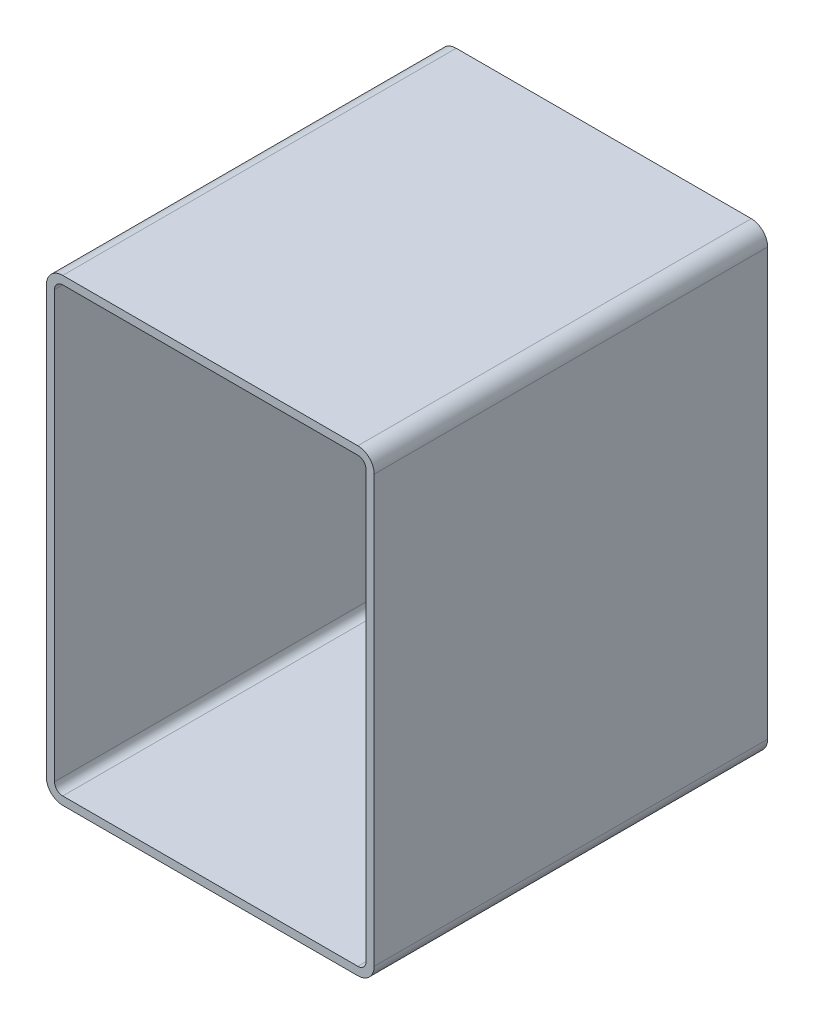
ISO-10303-21;
HEADER;
FILE_DESCRIPTION(('STEP AP214'),'2;1');
FILE_NAME('part.step','',(''),(''),'','','');
FILE_SCHEMA(('AUTOMOTIVE_DESIGN { 1 0 10303 214 1 1 1 1 }'));
ENDSEC;
DATA;
#1=APPLICATION_CONTEXT('core data for automotive mechanical design processes');
#2=APPLICATION_PROTOCOL_DEFINITION('international standard','automotive_design',2000,#1);
#3=PRODUCT_CONTEXT('',#1,'mechanical');
#4=PRODUCT('Part','Part','',(#3));
#5=PRODUCT_RELATED_PRODUCT_CATEGORY('part','',(#4));
#6=PRODUCT_DEFINITION_FORMATION('','',#4);
#7=PRODUCT_DEFINITION_CONTEXT('part definition',#1,'design');
#8=PRODUCT_DEFINITION('design','',#6,#7);
#9=PRODUCT_DEFINITION_SHAPE('','',#8);
#10=(LENGTH_UNIT() NAMED_UNIT(*) SI_UNIT(.MILLI.,.METRE.));
#11=(NAMED_UNIT(*) PLANE_ANGLE_UNIT() SI_UNIT($,.RADIAN.));
#12=(NAMED_UNIT(*) SI_UNIT($,.STERADIAN.) SOLID_ANGLE_UNIT());
#13=UNCERTAINTY_MEASURE_WITH_UNIT(LENGTH_MEASURE(1.E-05),#10,'distance_accuracy_value','');
#14=(GEOMETRIC_REPRESENTATION_CONTEXT(3) GLOBAL_UNCERTAINTY_ASSIGNED_CONTEXT((#13)) GLOBAL_UNIT_ASSIGNED_CONTEXT((#10,
#11,#12)) REPRESENTATION_CONTEXT('',''));
#15=CARTESIAN_POINT('',(0.,0.,0.));
#16=DIRECTION('',(0.,0.,1.));
#17=DIRECTION('',(1.,0.,0.));
#18=AXIS2_PLACEMENT_3D('',#15,#16,#17);
#19=CARTESIAN_POINT('',(15.4345794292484,344.728679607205,304.8));
#20=DIRECTION('',(0.,0.,1.));
#21=DIRECTION('',(1.,0.,0.));
#22=AXIS2_PLACEMENT_3D('',#19,#20,#21);
#23=PLANE('',#22);
#24=CARTESIAN_POINT('',(15.4345794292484,344.728679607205,304.8));
#25=DIRECTION('',(0.,0.,1.));
#26=DIRECTION('',(1.,0.,0.));
#27=AXIS2_PLACEMENT_3D('',#24,#25,#26);
#28=CIRCLE('',#27,12.7);
#29=CARTESIAN_POINT('',(15.4345794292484,357.428679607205,304.8));
#30=VERTEX_POINT('',#29);
#31=CARTESIAN_POINT('',(2.73457942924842,344.728679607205,304.8));
#32=VERTEX_POINT('',#31);
#33=EDGE_CURVE('E211',#30,#32,#28,.T.);
#34=ORIENTED_EDGE('',*,*,#33,.T.);
#35=DIRECTION('',(0.,-1.,0.));
#36=VECTOR('',#35,1.);
#37=CARTESIAN_POINT('',(2.73457942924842,14.5286796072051,304.8));
#38=LINE('',#37,#36);
#39=CARTESIAN_POINT('',(2.73457942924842,14.5286796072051,304.8));
#40=VERTEX_POINT('',#39);
#41=EDGE_CURVE('E214',#32,#40,#38,.T.);
#42=ORIENTED_EDGE('',*,*,#41,.T.);
#43=CARTESIAN_POINT('',(15.4345794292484,14.5286796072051,304.8));
#44=DIRECTION('',(0.,0.,1.));
#45=DIRECTION('',(1.,0.,0.));
#46=AXIS2_PLACEMENT_3D('',#43,#44,#45);
#47=CIRCLE('',#46,12.7);
#48=CARTESIAN_POINT('',(15.4345794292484,1.82867960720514,304.8));
#49=VERTEX_POINT('',#48);
#50=EDGE_CURVE('E217',#40,#49,#47,.T.);
#51=ORIENTED_EDGE('',*,*,#50,.T.);
#52=DIRECTION('',(1.,0.,0.));
#53=VECTOR('',#52,1.);
#54=CARTESIAN_POINT('',(244.034579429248,1.82867960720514,304.8));
#55=LINE('',#54,#53);
#56=CARTESIAN_POINT('',(244.034579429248,1.82867960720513,304.8));
#57=VERTEX_POINT('',#56);
#58=EDGE_CURVE('E219',#49,#57,#55,.T.);
#59=ORIENTED_EDGE('',*,*,#58,.T.);
#60=CARTESIAN_POINT('',(244.034579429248,14.5286796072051,304.8));
#61=DIRECTION('',(0.,0.,1.));
#62=DIRECTION('',(1.,0.,0.));
#63=AXIS2_PLACEMENT_3D('',#60,#61,#62);
#64=CIRCLE('',#63,12.7);
#65=CARTESIAN_POINT('',(256.734579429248,14.5286796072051,304.8));
#66=VERTEX_POINT('',#65);
#67=EDGE_CURVE('E221',#57,#66,#64,.T.);
#68=ORIENTED_EDGE('',*,*,#67,.T.);
#69=DIRECTION('',(0.,1.,0.));
#70=VECTOR('',#69,1.);
#71=CARTESIAN_POINT('',(256.734579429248,344.728679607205,304.8));
#72=LINE('',#71,#70);
#73=CARTESIAN_POINT('',(256.734579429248,344.728679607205,304.8));
#74=VERTEX_POINT('',#73);
#75=EDGE_CURVE('E223',#66,#74,#72,.T.);
#76=ORIENTED_EDGE('',*,*,#75,.T.);
#77=CARTESIAN_POINT('',(244.034579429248,344.728679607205,304.8));
#78=DIRECTION('',(0.,0.,1.));
#79=DIRECTION('',(1.,0.,0.));
#80=AXIS2_PLACEMENT_3D('',#77,#78,#79);
#81=CIRCLE('',#80,12.7);
#82=CARTESIAN_POINT('',(244.034579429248,357.428679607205,304.8));
#83=VERTEX_POINT('',#82);
#84=EDGE_CURVE('E225',#74,#83,#81,.T.);
#85=ORIENTED_EDGE('',*,*,#84,.T.);
#86=DIRECTION('',(-1.,0.,0.));
#87=VECTOR('',#86,1.);
#88=CARTESIAN_POINT('',(15.4345794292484,357.428679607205,304.8));
#89=LINE('',#88,#87);
#90=EDGE_CURVE('E227',#83,#30,#89,.T.);
#91=ORIENTED_EDGE('',*,*,#90,.T.);
#92=EDGE_LOOP('',(#34,#42,#51,#59,#68,#76,#85,#91));
#93=FACE_BOUND('',#92,.T.);
#94=DIRECTION('',(0.,-1.,0.));
#95=VECTOR('',#94,1.);
#96=CARTESIAN_POINT('',(9.08457942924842,14.5286796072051,304.8));
#97=LINE('',#96,#95);
#98=CARTESIAN_POINT('',(9.08457942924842,344.728679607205,304.8));
#99=VERTEX_POINT('',#98);
#100=CARTESIAN_POINT('',(9.08457942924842,14.5286796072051,304.8));
#101=VERTEX_POINT('',#100);
#102=EDGE_CURVE('E154',#99,#101,#97,.T.);
#103=ORIENTED_EDGE('',*,*,#102,.F.);
#104=CARTESIAN_POINT('',(15.4345794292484,344.728679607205,304.8));
#105=DIRECTION('',(0.,0.,1.));
#106=DIRECTION('',(1.,0.,0.));
#107=AXIS2_PLACEMENT_3D('',#104,#105,#106);
#108=CIRCLE('',#107,6.35000000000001);
#109=CARTESIAN_POINT('',(15.4345794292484,351.078679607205,304.8));
#110=VERTEX_POINT('',#109);
#111=EDGE_CURVE('E146',#110,#99,#108,.T.);
#112=ORIENTED_EDGE('',*,*,#111,.F.);
#113=DIRECTION('',(-1.,0.,0.));
#114=VECTOR('',#113,1.);
#115=CARTESIAN_POINT('',(15.4345794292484,351.078679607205,304.8));
#116=LINE('',#115,#114);
#117=CARTESIAN_POINT('',(244.034579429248,351.078679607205,304.8));
#118=VERTEX_POINT('',#117);
#119=EDGE_CURVE('E179',#118,#110,#116,.T.);
#120=ORIENTED_EDGE('',*,*,#119,.F.);
#121=CARTESIAN_POINT('',(244.034579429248,344.728679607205,304.8));
#122=DIRECTION('',(0.,0.,1.));
#123=DIRECTION('',(1.,0.,0.));
#124=AXIS2_PLACEMENT_3D('',#121,#122,#123);
#125=CIRCLE('',#124,6.35000000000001);
#126=CARTESIAN_POINT('',(250.384579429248,344.728679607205,304.8));
#127=VERTEX_POINT('',#126);
#128=EDGE_CURVE('E177',#127,#118,#125,.T.);
#129=ORIENTED_EDGE('',*,*,#128,.F.);
#130=DIRECTION('',(0.,1.,0.));
#131=VECTOR('',#130,1.);
#132=CARTESIAN_POINT('',(250.384579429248,344.728679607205,304.8));
#133=LINE('',#132,#131);
#134=CARTESIAN_POINT('',(250.384579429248,14.5286796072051,304.8));
#135=VERTEX_POINT('',#134);
#136=EDGE_CURVE('E175',#135,#127,#133,.T.);
#137=ORIENTED_EDGE('',*,*,#136,.F.);
#138=CARTESIAN_POINT('',(244.034579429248,14.5286796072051,304.8));
#139=DIRECTION('',(0.,0.,1.));
#140=DIRECTION('',(1.,0.,0.));
#141=AXIS2_PLACEMENT_3D('',#138,#139,#140);
#142=CIRCLE('',#141,6.35);
#143=CARTESIAN_POINT('',(244.034579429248,8.17867960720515,304.8));
#144=VERTEX_POINT('',#143);
#145=EDGE_CURVE('E173',#144,#135,#142,.T.);
#146=ORIENTED_EDGE('',*,*,#145,.F.);
#147=DIRECTION('',(1.,0.,0.));
#148=VECTOR('',#147,1.);
#149=CARTESIAN_POINT('',(244.034579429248,8.17867960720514,304.8));
#150=LINE('',#149,#148);
#151=CARTESIAN_POINT('',(15.4345794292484,8.17867960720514,304.8));
#152=VERTEX_POINT('',#151);
#153=EDGE_CURVE('E169',#152,#144,#150,.T.);
#154=ORIENTED_EDGE('',*,*,#153,.F.);
#155=CARTESIAN_POINT('',(15.4345794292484,14.5286796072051,304.8));
#156=DIRECTION('',(0.,0.,1.));
#157=DIRECTION('',(1.,0.,0.));
#158=AXIS2_PLACEMENT_3D('',#155,#156,#157);
#159=CIRCLE('',#158,6.35);
#160=EDGE_CURVE('E167',#101,#152,#159,.T.);
#161=ORIENTED_EDGE('',*,*,#160,.F.);
#162=EDGE_LOOP('',(#103,#112,#120,#129,#137,#146,#154,#161));
#163=FACE_BOUND('',#162,.T.);
#164=ADVANCED_FACE('F33',(#93,#163),#23,.T.);
#165=CARTESIAN_POINT('',(15.4345794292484,344.728679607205,0.));
#166=DIRECTION('',(0.,0.,1.));
#167=DIRECTION('',(1.,0.,0.));
#168=AXIS2_PLACEMENT_3D('',#165,#166,#167);
#169=PLANE('',#168);
#170=CARTESIAN_POINT('',(15.4345794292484,344.728679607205,0.));
#171=DIRECTION('',(0.,0.,1.));
#172=DIRECTION('',(1.,0.,0.));
#173=AXIS2_PLACEMENT_3D('',#170,#171,#172);
#174=CIRCLE('',#173,12.7);
#175=CARTESIAN_POINT('',(15.4345794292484,357.428679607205,0.));
#176=VERTEX_POINT('',#175);
#177=CARTESIAN_POINT('',(2.73457942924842,344.728679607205,0.));
#178=VERTEX_POINT('',#177);
#179=EDGE_CURVE('E162',#176,#178,#174,.T.);
#180=ORIENTED_EDGE('',*,*,#179,.F.);
#181=DIRECTION('',(-1.,0.,0.));
#182=VECTOR('',#181,1.);
#183=CARTESIAN_POINT('',(15.4345794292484,357.428679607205,0.));
#184=LINE('',#183,#182);
#185=CARTESIAN_POINT('',(244.034579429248,357.428679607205,0.));
#186=VERTEX_POINT('',#185);
#187=EDGE_CURVE('E215',#186,#176,#184,.T.);
#188=ORIENTED_EDGE('',*,*,#187,.F.);
#189=CARTESIAN_POINT('',(244.034579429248,344.728679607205,0.));
#190=DIRECTION('',(0.,0.,1.));
#191=DIRECTION('',(1.,0.,0.));
#192=AXIS2_PLACEMENT_3D('',#189,#190,#191);
#193=CIRCLE('',#192,12.7);
#194=CARTESIAN_POINT('',(256.734579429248,344.728679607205,0.));
#195=VERTEX_POINT('',#194);
#196=EDGE_CURVE('E242',#195,#186,#193,.T.);
#197=ORIENTED_EDGE('',*,*,#196,.F.);
#198=DIRECTION('',(0.,1.,0.));
#199=VECTOR('',#198,1.);
#200=CARTESIAN_POINT('',(256.734579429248,344.728679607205,0.));
#201=LINE('',#200,#199);
#202=CARTESIAN_POINT('',(256.734579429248,14.5286796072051,0.));
#203=VERTEX_POINT('',#202);
#204=EDGE_CURVE('E240',#203,#195,#201,.T.);
#205=ORIENTED_EDGE('',*,*,#204,.F.);
#206=CARTESIAN_POINT('',(244.034579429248,14.5286796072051,0.));
#207=DIRECTION('',(0.,0.,1.));
#208=DIRECTION('',(1.,0.,0.));
#209=AXIS2_PLACEMENT_3D('',#206,#207,#208);
#210=CIRCLE('',#209,12.7);
#211=CARTESIAN_POINT('',(244.034579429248,1.82867960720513,0.));
#212=VERTEX_POINT('',#211);
#213=EDGE_CURVE('E238',#212,#203,#210,.T.);
#214=ORIENTED_EDGE('',*,*,#213,.F.);
#215=DIRECTION('',(1.,0.,0.));
#216=VECTOR('',#215,1.);
#217=CARTESIAN_POINT('',(244.034579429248,1.82867960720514,0.));
#218=LINE('',#217,#216);
#219=CARTESIAN_POINT('',(15.4345794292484,1.82867960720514,0.));
#220=VERTEX_POINT('',#219);
#221=EDGE_CURVE('E236',#220,#212,#218,.T.);
#222=ORIENTED_EDGE('',*,*,#221,.F.);
#223=CARTESIAN_POINT('',(15.4345794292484,14.5286796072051,0.));
#224=DIRECTION('',(0.,0.,1.));
#225=DIRECTION('',(1.,0.,0.));
#226=AXIS2_PLACEMENT_3D('',#223,#224,#225);
#227=CIRCLE('',#226,12.7);
#228=CARTESIAN_POINT('',(2.73457942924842,14.5286796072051,0.));
#229=VERTEX_POINT('',#228);
#230=EDGE_CURVE('E234',#229,#220,#227,.T.);
#231=ORIENTED_EDGE('',*,*,#230,.F.);
#232=DIRECTION('',(0.,-1.,0.));
#233=VECTOR('',#232,1.);
#234=CARTESIAN_POINT('',(2.73457942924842,14.5286796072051,0.));
#235=LINE('',#234,#233);
#236=EDGE_CURVE('E232',#178,#229,#235,.T.);
#237=ORIENTED_EDGE('',*,*,#236,.F.);
#238=EDGE_LOOP('',(#180,#188,#197,#205,#214,#222,#231,#237));
#239=FACE_BOUND('',#238,.T.);
#240=CARTESIAN_POINT('',(15.4345794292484,344.728679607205,0.));
#241=DIRECTION('',(0.,0.,1.));
#242=DIRECTION('',(1.,0.,0.));
#243=AXIS2_PLACEMENT_3D('',#240,#241,#242);
#244=CIRCLE('',#243,6.35000000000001);
#245=CARTESIAN_POINT('',(15.4345794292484,351.078679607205,0.));
#246=VERTEX_POINT('',#245);
#247=CARTESIAN_POINT('',(9.08457942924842,344.728679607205,0.));
#248=VERTEX_POINT('',#247);
#249=EDGE_CURVE('E56',#246,#248,#244,.T.);
#250=ORIENTED_EDGE('',*,*,#249,.T.);
#251=DIRECTION('',(0.,-1.,0.));
#252=VECTOR('',#251,1.);
#253=CARTESIAN_POINT('',(9.08457942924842,14.5286796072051,0.));
#254=LINE('',#253,#252);
#255=CARTESIAN_POINT('',(9.08457942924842,14.5286796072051,0.));
#256=VERTEX_POINT('',#255);
#257=EDGE_CURVE('E161',#248,#256,#254,.T.);
#258=ORIENTED_EDGE('',*,*,#257,.T.);
#259=CARTESIAN_POINT('',(15.4345794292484,14.5286796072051,0.));
#260=DIRECTION('',(0.,0.,1.));
#261=DIRECTION('',(1.,0.,0.));
#262=AXIS2_PLACEMENT_3D('',#259,#260,#261);
#263=CIRCLE('',#262,6.35);
#264=CARTESIAN_POINT('',(15.4345794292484,8.17867960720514,0.));
#265=VERTEX_POINT('',#264);
#266=EDGE_CURVE('E183',#256,#265,#263,.T.);
#267=ORIENTED_EDGE('',*,*,#266,.T.);
#268=DIRECTION('',(1.,0.,0.));
#269=VECTOR('',#268,1.);
#270=CARTESIAN_POINT('',(244.034579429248,8.17867960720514,0.));
#271=LINE('',#270,#269);
#272=CARTESIAN_POINT('',(244.034579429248,8.17867960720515,0.));
#273=VERTEX_POINT('',#272);
#274=EDGE_CURVE('E186',#265,#273,#271,.T.);
#275=ORIENTED_EDGE('',*,*,#274,.T.);
#276=CARTESIAN_POINT('',(244.034579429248,14.5286796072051,0.));
#277=DIRECTION('',(0.,0.,1.));
#278=DIRECTION('',(1.,0.,0.));
#279=AXIS2_PLACEMENT_3D('',#276,#277,#278);
#280=CIRCLE('',#279,6.35);
#281=CARTESIAN_POINT('',(250.384579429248,14.5286796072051,0.));
#282=VERTEX_POINT('',#281);
#283=EDGE_CURVE('E189',#273,#282,#280,.T.);
#284=ORIENTED_EDGE('',*,*,#283,.T.);
#285=DIRECTION('',(0.,1.,0.));
#286=VECTOR('',#285,1.);
#287=CARTESIAN_POINT('',(250.384579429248,344.728679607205,0.));
#288=LINE('',#287,#286);
#289=CARTESIAN_POINT('',(250.384579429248,344.728679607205,0.));
#290=VERTEX_POINT('',#289);
#291=EDGE_CURVE('E192',#282,#290,#288,.T.);
#292=ORIENTED_EDGE('',*,*,#291,.T.);
#293=CARTESIAN_POINT('',(244.034579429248,344.728679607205,0.));
#294=DIRECTION('',(0.,0.,1.));
#295=DIRECTION('',(1.,0.,0.));
#296=AXIS2_PLACEMENT_3D('',#293,#294,#295);
#297=CIRCLE('',#296,6.35000000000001);
#298=CARTESIAN_POINT('',(244.034579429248,351.078679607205,0.));
#299=VERTEX_POINT('',#298);
#300=EDGE_CURVE('E195',#290,#299,#297,.T.);
#301=ORIENTED_EDGE('',*,*,#300,.T.);
#302=DIRECTION('',(-1.,0.,0.));
#303=VECTOR('',#302,1.);
#304=CARTESIAN_POINT('',(15.4345794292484,351.078679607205,0.));
#305=LINE('',#304,#303);
#306=EDGE_CURVE('E155',#299,#246,#305,.T.);
#307=ORIENTED_EDGE('',*,*,#306,.T.);
#308=EDGE_LOOP('',(#250,#258,#267,#275,#284,#292,#301,#307));
#309=FACE_BOUND('',#308,.T.);
#310=ADVANCED_FACE('F272',(#239,#309),#169,.F.);
#311=CARTESIAN_POINT('',(15.4345794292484,344.728679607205,304.8));
#312=DIRECTION('',(0.,0.,-1.));
#313=DIRECTION('',(-1.,0.,0.));
#314=AXIS2_PLACEMENT_3D('',#311,#312,#313);
#315=CYLINDRICAL_SURFACE('',#314,12.7);
#316=ORIENTED_EDGE('',*,*,#179,.T.);
#317=DIRECTION('',(0.,0.,-1.));
#318=VECTOR('',#317,1.);
#319=CARTESIAN_POINT('',(2.73457942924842,344.728679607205,304.8));
#320=LINE('',#319,#318);
#321=EDGE_CURVE('E11',#32,#178,#320,.T.);
#322=ORIENTED_EDGE('',*,*,#321,.F.);
#323=ORIENTED_EDGE('',*,*,#33,.F.);
#324=DIRECTION('',(0.,0.,-1.));
#325=VECTOR('',#324,1.);
#326=CARTESIAN_POINT('',(15.4345794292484,357.428679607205,304.8));
#327=LINE('',#326,#325);
#328=EDGE_CURVE('E229',#30,#176,#327,.T.);
#329=ORIENTED_EDGE('',*,*,#328,.T.);
#330=EDGE_LOOP('',(#316,#322,#323,#329));
#331=FACE_BOUND('',#330,.T.);
#332=ADVANCED_FACE('F35',(#331),#315,.T.);
#333=CARTESIAN_POINT('',(2.73457942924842,14.5286796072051,304.8));
#334=DIRECTION('',(1.,0.,0.));
#335=DIRECTION('',(0.,0.,-1.));
#336=AXIS2_PLACEMENT_3D('',#333,#334,#335);
#337=PLANE('',#336);
#338=ORIENTED_EDGE('',*,*,#236,.T.);
#339=DIRECTION('',(0.,0.,-1.));
#340=VECTOR('',#339,1.);
#341=CARTESIAN_POINT('',(2.73457942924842,14.5286796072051,304.8));
#342=LINE('',#341,#340);
#343=EDGE_CURVE('E41',#40,#229,#342,.T.);
#344=ORIENTED_EDGE('',*,*,#343,.F.);
#345=ORIENTED_EDGE('',*,*,#41,.F.);
#346=ORIENTED_EDGE('',*,*,#321,.T.);
#347=EDGE_LOOP('',(#338,#344,#345,#346));
#348=FACE_BOUND('',#347,.T.);
#349=ADVANCED_FACE('F289',(#348),#337,.F.);
#350=CARTESIAN_POINT('',(15.4345794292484,14.5286796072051,304.8));
#351=DIRECTION('',(0.,0.,-1.));
#352=DIRECTION('',(-1.,0.,0.));
#353=AXIS2_PLACEMENT_3D('',#350,#351,#352);
#354=CYLINDRICAL_SURFACE('',#353,12.7);
#355=ORIENTED_EDGE('',*,*,#230,.T.);
#356=DIRECTION('',(0.,0.,-1.));
#357=VECTOR('',#356,1.);
#358=CARTESIAN_POINT('',(15.4345794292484,1.82867960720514,304.8));
#359=LINE('',#358,#357);
#360=EDGE_CURVE('E259',#49,#220,#359,.T.);
#361=ORIENTED_EDGE('',*,*,#360,.F.);
#362=ORIENTED_EDGE('',*,*,#50,.F.);
#363=ORIENTED_EDGE('',*,*,#343,.T.);
#364=EDGE_LOOP('',(#355,#361,#362,#363));
#365=FACE_BOUND('',#364,.T.);
#366=ADVANCED_FACE('F266',(#365),#354,.T.);
#367=CARTESIAN_POINT('',(244.034579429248,1.82867960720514,304.8));
#368=DIRECTION('',(0.,1.,0.));
#369=DIRECTION('',(0.,0.,1.));
#370=AXIS2_PLACEMENT_3D('',#367,#368,#369);
#371=PLANE('',#370);
#372=ORIENTED_EDGE('',*,*,#221,.T.);
#373=DIRECTION('',(0.,0.,-1.));
#374=VECTOR('',#373,1.);
#375=CARTESIAN_POINT('',(244.034579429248,1.82867960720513,304.8));
#376=LINE('',#375,#374);
#377=EDGE_CURVE('E256',#57,#212,#376,.T.);
#378=ORIENTED_EDGE('',*,*,#377,.F.);
#379=ORIENTED_EDGE('',*,*,#58,.F.);
#380=ORIENTED_EDGE('',*,*,#360,.T.);
#381=EDGE_LOOP('',(#372,#378,#379,#380));
#382=FACE_BOUND('',#381,.T.);
#383=ADVANCED_FACE('F278',(#382),#371,.F.);
#384=CARTESIAN_POINT('',(244.034579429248,14.5286796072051,304.8));
#385=DIRECTION('',(0.,0.,-1.));
#386=DIRECTION('',(-1.,0.,0.));
#387=AXIS2_PLACEMENT_3D('',#384,#385,#386);
#388=CYLINDRICAL_SURFACE('',#387,12.7);
#389=ORIENTED_EDGE('',*,*,#213,.T.);
#390=DIRECTION('',(0.,0.,-1.));
#391=VECTOR('',#390,1.);
#392=CARTESIAN_POINT('',(256.734579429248,14.5286796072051,304.8));
#393=LINE('',#392,#391);
#394=EDGE_CURVE('E253',#66,#203,#393,.T.);
#395=ORIENTED_EDGE('',*,*,#394,.F.);
#396=ORIENTED_EDGE('',*,*,#67,.F.);
#397=ORIENTED_EDGE('',*,*,#377,.T.);
#398=EDGE_LOOP('',(#389,#395,#396,#397));
#399=FACE_BOUND('',#398,.T.);
#400=ADVANCED_FACE('F282',(#399),#388,.T.);
#401=CARTESIAN_POINT('',(256.734579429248,344.728679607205,304.8));
#402=DIRECTION('',(-1.,0.,0.));
#403=DIRECTION('',(0.,0.,1.));
#404=AXIS2_PLACEMENT_3D('',#401,#402,#403);
#405=PLANE('',#404);
#406=ORIENTED_EDGE('',*,*,#204,.T.);
#407=DIRECTION('',(0.,0.,-1.));
#408=VECTOR('',#407,1.);
#409=CARTESIAN_POINT('',(256.734579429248,344.728679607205,304.8));
#410=LINE('',#409,#408);
#411=EDGE_CURVE('E250',#74,#195,#410,.T.);
#412=ORIENTED_EDGE('',*,*,#411,.F.);
#413=ORIENTED_EDGE('',*,*,#75,.F.);
#414=ORIENTED_EDGE('',*,*,#394,.T.);
#415=EDGE_LOOP('',(#406,#412,#413,#414));
#416=FACE_BOUND('',#415,.T.);
#417=ADVANCED_FACE('F302',(#416),#405,.F.);
#418=CARTESIAN_POINT('',(244.034579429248,344.728679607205,304.8));
#419=DIRECTION('',(0.,0.,-1.));
#420=DIRECTION('',(-1.,0.,0.));
#421=AXIS2_PLACEMENT_3D('',#418,#419,#420);
#422=CYLINDRICAL_SURFACE('',#421,12.7);
#423=ORIENTED_EDGE('',*,*,#196,.T.);
#424=DIRECTION('',(0.,0.,-1.));
#425=VECTOR('',#424,1.);
#426=CARTESIAN_POINT('',(244.034579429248,357.428679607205,304.8));
#427=LINE('',#426,#425);
#428=EDGE_CURVE('E247',#83,#186,#427,.T.);
#429=ORIENTED_EDGE('',*,*,#428,.F.);
#430=ORIENTED_EDGE('',*,*,#84,.F.);
#431=ORIENTED_EDGE('',*,*,#411,.T.);
#432=EDGE_LOOP('',(#423,#429,#430,#431));
#433=FACE_BOUND('',#432,.T.);
#434=ADVANCED_FACE('F300',(#433),#422,.T.);
#435=CARTESIAN_POINT('',(15.4345794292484,357.428679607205,304.8));
#436=DIRECTION('',(0.,-1.,0.));
#437=DIRECTION('',(0.,0.,-1.));
#438=AXIS2_PLACEMENT_3D('',#435,#436,#437);
#439=PLANE('',#438);
#440=ORIENTED_EDGE('',*,*,#187,.T.);
#441=ORIENTED_EDGE('',*,*,#328,.F.);
#442=ORIENTED_EDGE('',*,*,#90,.F.);
#443=ORIENTED_EDGE('',*,*,#428,.T.);
#444=EDGE_LOOP('',(#440,#441,#442,#443));
#445=FACE_BOUND('',#444,.T.);
#446=ADVANCED_FACE('F295',(#445),#439,.F.);
#447=CARTESIAN_POINT('',(15.4345794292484,344.728679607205,304.8));
#448=DIRECTION('',(0.,0.,-1.));
#449=DIRECTION('',(-1.,0.,0.));
#450=AXIS2_PLACEMENT_3D('',#447,#448,#449);
#451=CYLINDRICAL_SURFACE('',#450,6.35000000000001);
#452=ORIENTED_EDGE('',*,*,#249,.F.);
#453=DIRECTION('',(0.,0.,-1.));
#454=VECTOR('',#453,1.);
#455=CARTESIAN_POINT('',(15.4345794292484,351.078679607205,304.8));
#456=LINE('',#455,#454);
#457=EDGE_CURVE('E150',#110,#246,#456,.T.);
#458=ORIENTED_EDGE('',*,*,#457,.F.);
#459=ORIENTED_EDGE('',*,*,#111,.T.);
#460=DIRECTION('',(0.,0.,-1.));
#461=VECTOR('',#460,1.);
#462=CARTESIAN_POINT('',(9.08457942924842,344.728679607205,304.8));
#463=LINE('',#462,#461);
#464=EDGE_CURVE('E149',#99,#248,#463,.T.);
#465=ORIENTED_EDGE('',*,*,#464,.T.);
#466=EDGE_LOOP('',(#452,#458,#459,#465));
#467=FACE_BOUND('',#466,.T.);
#468=ADVANCED_FACE('F148',(#467),#451,.F.);
#469=CARTESIAN_POINT('',(9.08457942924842,14.5286796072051,304.8));
#470=DIRECTION('',(1.,0.,0.));
#471=DIRECTION('',(0.,0.,-1.));
#472=AXIS2_PLACEMENT_3D('',#469,#470,#471);
#473=PLANE('',#472);
#474=ORIENTED_EDGE('',*,*,#257,.F.);
#475=ORIENTED_EDGE('',*,*,#464,.F.);
#476=ORIENTED_EDGE('',*,*,#102,.T.);
#477=DIRECTION('',(0.,0.,-1.));
#478=VECTOR('',#477,1.);
#479=CARTESIAN_POINT('',(9.08457942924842,14.5286796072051,304.8));
#480=LINE('',#479,#478);
#481=EDGE_CURVE('E163',#101,#256,#480,.T.);
#482=ORIENTED_EDGE('',*,*,#481,.T.);
#483=EDGE_LOOP('',(#474,#475,#476,#482));
#484=FACE_BOUND('',#483,.T.);
#485=ADVANCED_FACE('F158',(#484),#473,.T.);
#486=CARTESIAN_POINT('',(15.4345794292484,14.5286796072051,304.8));
#487=DIRECTION('',(0.,0.,-1.));
#488=DIRECTION('',(-1.,0.,0.));
#489=AXIS2_PLACEMENT_3D('',#486,#487,#488);
#490=CYLINDRICAL_SURFACE('',#489,6.35);
#491=ORIENTED_EDGE('',*,*,#266,.F.);
#492=ORIENTED_EDGE('',*,*,#481,.F.);
#493=ORIENTED_EDGE('',*,*,#160,.T.);
#494=DIRECTION('',(0.,0.,-1.));
#495=VECTOR('',#494,1.);
#496=CARTESIAN_POINT('',(15.4345794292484,8.17867960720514,304.8));
#497=LINE('',#496,#495);
#498=EDGE_CURVE('E208',#152,#265,#497,.T.);
#499=ORIENTED_EDGE('',*,*,#498,.T.);
#500=EDGE_LOOP('',(#491,#492,#493,#499));
#501=FACE_BOUND('',#500,.T.);
#502=ADVANCED_FACE('F327',(#501),#490,.F.);
#503=CARTESIAN_POINT('',(244.034579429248,8.17867960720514,304.8));
#504=DIRECTION('',(0.,1.,0.));
#505=DIRECTION('',(0.,0.,1.));
#506=AXIS2_PLACEMENT_3D('',#503,#504,#505);
#507=PLANE('',#506);
#508=ORIENTED_EDGE('',*,*,#274,.F.);
#509=ORIENTED_EDGE('',*,*,#498,.F.);
#510=ORIENTED_EDGE('',*,*,#153,.T.);
#511=DIRECTION('',(0.,0.,-1.));
#512=VECTOR('',#511,1.);
#513=CARTESIAN_POINT('',(244.034579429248,8.17867960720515,304.8));
#514=LINE('',#513,#512);
#515=EDGE_CURVE('E206',#144,#273,#514,.T.);
#516=ORIENTED_EDGE('',*,*,#515,.T.);
#517=EDGE_LOOP('',(#508,#509,#510,#516));
#518=FACE_BOUND('',#517,.T.);
#519=ADVANCED_FACE('F331',(#518),#507,.T.);
#520=CARTESIAN_POINT('',(244.034579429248,14.5286796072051,304.8));
#521=DIRECTION('',(0.,0.,-1.));
#522=DIRECTION('',(-1.,0.,0.));
#523=AXIS2_PLACEMENT_3D('',#520,#521,#522);
#524=CYLINDRICAL_SURFACE('',#523,6.35);
#525=ORIENTED_EDGE('',*,*,#283,.F.);
#526=ORIENTED_EDGE('',*,*,#515,.F.);
#527=ORIENTED_EDGE('',*,*,#145,.T.);
#528=DIRECTION('',(0.,0.,-1.));
#529=VECTOR('',#528,1.);
#530=CARTESIAN_POINT('',(250.384579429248,14.5286796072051,304.8));
#531=LINE('',#530,#529);
#532=EDGE_CURVE('E204',#135,#282,#531,.T.);
#533=ORIENTED_EDGE('',*,*,#532,.T.);
#534=EDGE_LOOP('',(#525,#526,#527,#533));
#535=FACE_BOUND('',#534,.T.);
#536=ADVANCED_FACE('F337',(#535),#524,.F.);
#537=CARTESIAN_POINT('',(250.384579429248,344.728679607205,304.8));
#538=DIRECTION('',(-1.,0.,0.));
#539=DIRECTION('',(0.,0.,1.));
#540=AXIS2_PLACEMENT_3D('',#537,#538,#539);
#541=PLANE('',#540);
#542=ORIENTED_EDGE('',*,*,#291,.F.);
#543=ORIENTED_EDGE('',*,*,#532,.F.);
#544=ORIENTED_EDGE('',*,*,#136,.T.);
#545=DIRECTION('',(0.,0.,-1.));
#546=VECTOR('',#545,1.);
#547=CARTESIAN_POINT('',(250.384579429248,344.728679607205,304.8));
#548=LINE('',#547,#546);
#549=EDGE_CURVE('E202',#127,#290,#548,.T.);
#550=ORIENTED_EDGE('',*,*,#549,.T.);
#551=EDGE_LOOP('',(#542,#543,#544,#550));
#552=FACE_BOUND('',#551,.T.);
#553=ADVANCED_FACE('F341',(#552),#541,.T.);
#554=CARTESIAN_POINT('',(244.034579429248,344.728679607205,304.8));
#555=DIRECTION('',(0.,0.,-1.));
#556=DIRECTION('',(-1.,0.,0.));
#557=AXIS2_PLACEMENT_3D('',#554,#555,#556);
#558=CYLINDRICAL_SURFACE('',#557,6.35000000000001);
#559=ORIENTED_EDGE('',*,*,#300,.F.);
#560=ORIENTED_EDGE('',*,*,#549,.F.);
#561=ORIENTED_EDGE('',*,*,#128,.T.);
#562=DIRECTION('',(0.,0.,-1.));
#563=VECTOR('',#562,1.);
#564=CARTESIAN_POINT('',(244.034579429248,351.078679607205,304.8));
#565=LINE('',#564,#563);
#566=EDGE_CURVE('E48',#118,#299,#565,.T.);
#567=ORIENTED_EDGE('',*,*,#566,.T.);
#568=EDGE_LOOP('',(#559,#560,#561,#567));
#569=FACE_BOUND('',#568,.T.);
#570=ADVANCED_FACE('F345',(#569),#558,.F.);
#571=CARTESIAN_POINT('',(15.4345794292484,351.078679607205,304.8));
#572=DIRECTION('',(0.,-1.,0.));
#573=DIRECTION('',(0.,0.,-1.));
#574=AXIS2_PLACEMENT_3D('',#571,#572,#573);
#575=PLANE('',#574);
#576=ORIENTED_EDGE('',*,*,#306,.F.);
#577=ORIENTED_EDGE('',*,*,#566,.F.);
#578=ORIENTED_EDGE('',*,*,#119,.T.);
#579=ORIENTED_EDGE('',*,*,#457,.T.);
#580=EDGE_LOOP('',(#576,#577,#578,#579));
#581=FACE_BOUND('',#580,.T.);
#582=ADVANCED_FACE('F349',(#581),#575,.T.);
#583=CLOSED_SHELL('',(#164,#310,#332,#349,#366,#383,#400,#417,#434,#446,#468,#485,#502,#519,
#536,#553,#570,#582));
#584=MANIFOLD_SOLID_BREP('B2',#583);
#585=ADVANCED_BREP_SHAPE_REPRESENTATION('',(#18,#584),#14);
#586=SHAPE_DEFINITION_REPRESENTATION(#9,#585);
ENDSEC;
END-ISO-10303-21;
